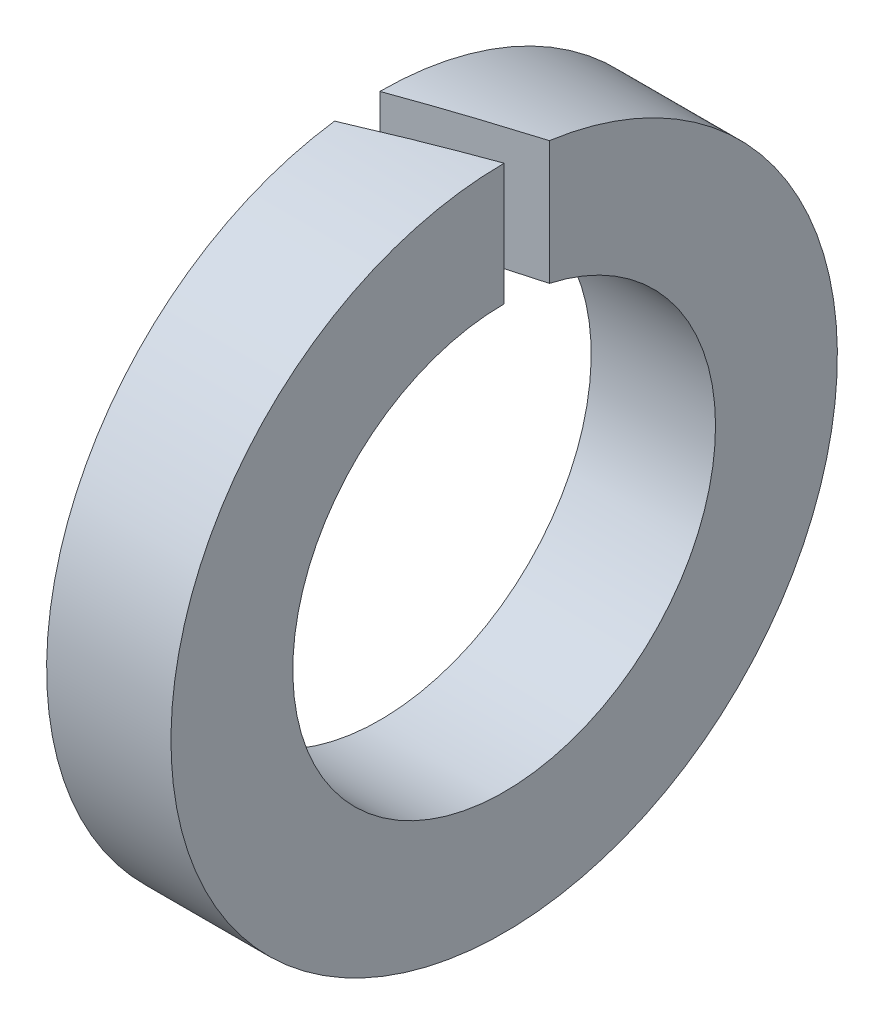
from build123d import *

# Parameters (mm, degrees)
ESQUISSE1_W             = 2.5
ESQUISSE1_H             = 2.45
ENL_V_MAT_EXTRU_1_DEPTH = 10.799489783


with BuildPart() as part:
    # Esquisse1 → Base-R_volution (revolve)
    with BuildSketch(Plane(origin=(0, 0, 0), x_dir=(1, 0, 0), z_dir=(0, 1, 0)), mode=Mode.PRIVATE) as base_r_volution_sk:
        with Locations((1.25, 5.475)):
            Rectangle(ESQUISSE1_W, ESQUISSE1_H)
    revolve(base_r_volution_sk.sketch.rotate(Axis((0, 0, 0), (1, 0, 0)), 180), axis=Axis((0, 0, 0), (1, 0, 0)))

    # Esquisse2 → Enl_v. mat.-Extru.1 (cut, through all)
    with BuildSketch(Plane(origin=(0, 0, 0), x_dir=(1, 0, 0), z_dir=(0, 1, 0))):
        Polygon((0, 0), (2.5, 0.909925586), (2.5, 0), (0, -0.909925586), align=None)
    extrude(amount=ENL_V_MAT_EXTRU_1_DEPTH, mode=Mode.SUBTRACT)


solid = part.part
